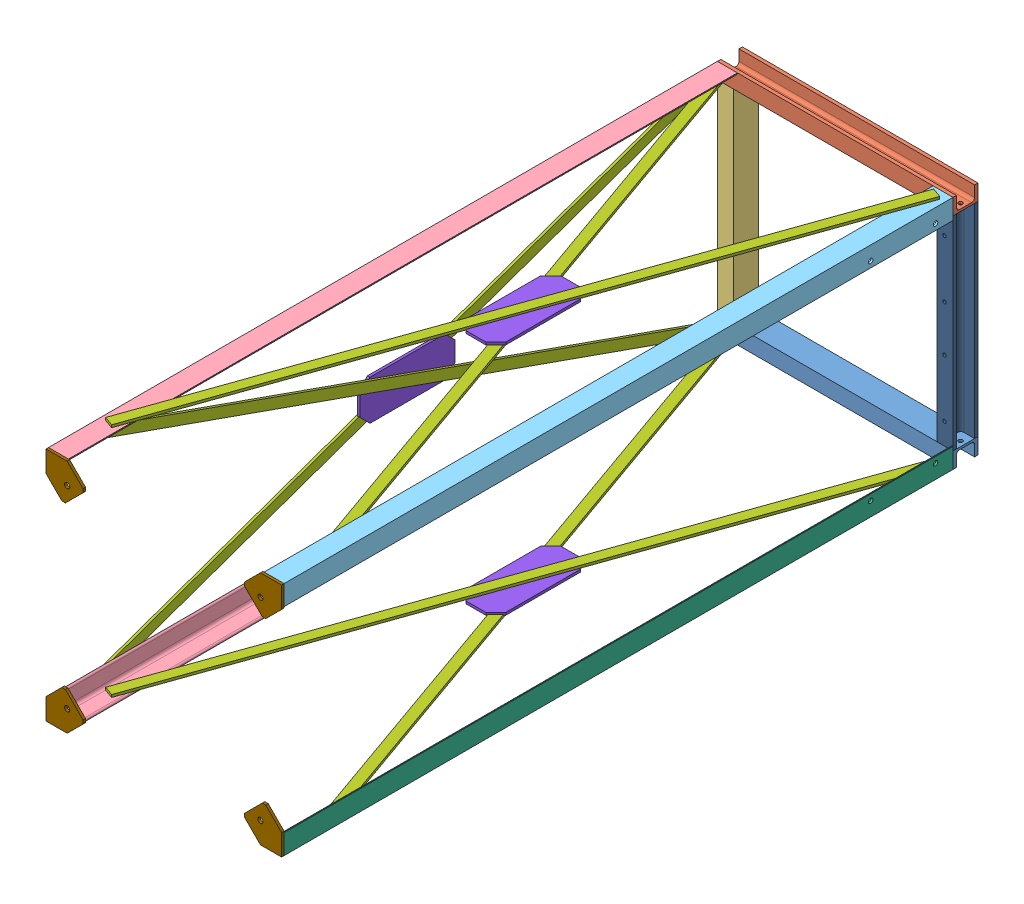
SolidWorks assembly particle separator 450.SLDASM, configuration full (file format 14000). Lengths in mm.
Overall size (514.43 514.43 2340).
30 component instances, 13 part files, 10 mates.
Components (placement in the parent):
- Bucket-1: Bucket.SLDASM [Initial] at (0 0 2400.118) x (1 0 0) z (0 0 -1) (suppressed, hidden)
- Frame-1: Frame.SLDASM [Initial] at (0 0 -1370) x (0 -1 0) z (1 0 0) size (514.43 1395 514.43)
  - Frame-basic-1: Frame-basic.SLDASM [Initial] at origin size (514.43 1395 514.43)
    - 3930-10449-4-01-1: 3930-10449-4-01.SLDPRT [Výchozí] at (220 0 0) size (32 50 472)
    - 3930-10450-4-01-1: 3930-10450-4-01.SLDPRT [Výchozí] at (-220 0 0) x (-1 0 0) z (0 0 -1) size (32 50 472)
    - 3930-10451-4-01-1: 3930-10451-4-01.SLDPRT [Výchozí] at (0 0 -220) x (0 0 -1) z (1 0 0) size (32 50 408)
    - 3930-10454-4-01-2: 3930-10454-4-01.SLDPRT [Výchozí] at (-216 -695 -216) x (1 0 0) z (0 -1 0) size (40 40 1340)
    - 3930-10454-4-01-1: 3930-10454-4-01.SLDPRT [Výchozí] at (216 -695 -216) x (0 0 1) z (0 -1 0) size (40 40 1340)
    - 3930-10455-4-01-1: 3930-10455-4-01.SLDPRT [Výchozí] at (-216 -695 216) x (1 0 0) z (0 1 0) size (40 40 1340)
    - 3930-10456-4-01-1: 3930-10456-4-01.SLDPRT [Výchozí] at (216 -695 216) x (0 0 -1) z (0 1 0) size (40 40 1340)
    - 3930-10459-4-01-4: 3930-10459-4-01.SLDPRT [Výchozí] at (-232 -651.1914 0) x (0 -0.333187 -0.942861) z (1 0 0) size (20 1300 5)
    - 3930-10459-4-01-1: 3930-10459-4-01.SLDPRT [Výchozí] at (-241 -651.1914 0) x (0 0.333187 -0.942861) z (1 0 0) size (20 1300 5)
    - Cross Gusset-1: Cross Gusset.SLDPRT [Výchozí] at (-232 -650 0) x (0 0 1) z (-1 0 0) size (80 190 5)
    - Feet-1: Feet.SLDPRT [Výchozí] at (-207.7157 -1370 207.7157) x (0.707107 0 -0.707107) z (0 1 0) size (80 60 5)
    - Feet-2: Feet.SLDPRT [Výchozí] at (207.7157 -1370 207.7157) x (-0.707107 0 -0.707107) z (0 1 0) size (80 60 5)
    - Feet-3: Feet.SLDPRT [Výchozí] at (207.7157 -1370 -207.7157) x (-0.707107 0 0.707107) z (0 1 0) size (80 60 5)
    - Feet-4: Feet.SLDPRT [Výchozí] at (-207.7157 -1370 -207.7157) x (0.707107 0 0.707107) z (0 1 0) size (80 60 5)
    - Cross Gusset-2: Cross Gusset.SLDPRT [Výchozí] at (0 -650 -232) x (-1 0 0) z (0 0 -1) size (80 190 5)
    - Cross Gusset-3: Cross Gusset.SLDPRT [Výchozí] at (232 -650 0) x (0 0 -1) z (1 0 0) size (80 190 5)
    - 3930-10459-4-01-5: 3930-10459-4-01.SLDPRT [Výchozí] at (0 -651.1914 -232) x (0.942861 -0.333187 0) z (0 0 1) size (20 1300 5)
    - 3930-10459-4-01-6: 3930-10459-4-01.SLDPRT [Výchozí] at (232 -651.1914 0) x (0 -0.333187 0.942861) z (-1 0 0) size (20 1300 5)
    - 3930-10459-4-01-2: 3930-10459-4-01.SLDPRT [Výchozí] at (0 -651.1914 -241) x (0.942861 0.333187 0) z (0 0 1) size (20 1300 5)
    - 3930-10459-4-01-3: 3930-10459-4-01.SLDPRT [Výchozí] at (241 -651.1914 0) x (0 0.333187 0.942861) z (-1 0 0) size (20 1300 5)
    - 3930-10108-4-01-1: 3930-10108-4-01.SLDPRT [Výchozí] at (-207 -25 217.5) x (0 0 1) z (0 -1 0) (suppressed, hidden)
    - 3930-10108-4-01-2: 3930-10108-4-01.SLDPRT [Výchozí] at (207 -25 217.5) x (0 0 1) z (0 -1 0) (suppressed, hidden)
  - Beam-1: Beam.SLDASM [Initial] at (0 0 220) x (0 0 1) z (-1 0 0) size (32 50 408)
    - 3930-10452-4-01-1: 3930-10452-4-01.SLDPRT [Výchozí] at origin size (32 50 408)
    - 3930-10104-4-01-1: 3930-10104-4-01.SLDPRT [Výchozí] at (2.5 0 199) (suppressed, hidden)
    - 3930-10104-4-01-2: 3930-10104-4-01.SLDPRT [Výchozí] at (2.5 0 -204) (suppressed, hidden)
- Cylcone Particle Separator-1: Cylcone Particle Separator.SLDPRT [Default<As Machined>] at (0 0 -2340) x (1 0 0) z (0 1 0) size (477.39 1845 480.7)
Mates (geometry in assembly coordinates):
- Sjednocený1: coincident: plane of Bucket-1 through (0 0 2400.118) normal (0 -1 0); plane of assembly through (0 0 0) normal (0 1 0)
- Sjednocený2: coincident: plane of Bucket-1; plane of assembly through (0 0 0) normal (1 0 0)
- Sjednocený4: coincident aligned: plane of Frame-1 through (0 0 -1370) normal (1 0 0); plane of assembly through (0 0 0) normal (1 0 0)
- Sjednocený5: coincident anti-aligned: plane of Frame-1 through (0 0 -1370) normal (0 -1 0); plane of assembly through (0 0 0) normal (0 1 0)
- Coincident9: coincident anti-aligned: plane of Frame-1/Frame-basic-1/3930-10451-4-01-1 through (-204 -204 -1395) normal (0 0 -1); plane of Cylcone Particle Separator-1 through (-238.6857 -60 -1395) normal (0 0 1)
- Parallel2: parallel aligned: plane of Frame-1/Frame-basic-1/3930-10451-4-01-1 through (-236 -204 -1395) normal (-1 0 0); plane of Cylcone Particle Separator-1 through (-238.6857 56 -1403) normal (-1 0 0)
- Parallel1: parallel aligned: plane of Frame-1/Frame-basic-1/3930-10449-4-01-1 through (236 -236 -1395) normal (0 -1 0); plane of Cylcone Particle Separator-1 through (-56 -238.6857 -1403) normal (0 -1 0)
- Coincident13: coincident aligned: plane of Frame-1/Frame-basic-1/Feet-1 through (257.2132 214.7868 0) normal (0 0 1); plane of assembly through (0 0 0) normal (0 0 1)
- Width5: width anti-aligned: plane of Frame-1/Frame-basic-1/3930-10450-4-01-1 through (236 214.4 -1382.2) normal (1 0 0); plane of Cylcone Particle Separator-1 through (-236 214.4 -1382.2) normal (-1 0 0); plane of Frame-1/Frame-basic-1/3930-10450-4-01-1 through (-60 238.6857 -1495) normal (-1 0 0); plane of Cylcone Particle Separator-1 through (60 238.6857 -1495) normal (1 0 0)
- Width6: width anti-aligned: plane of Frame-1/Frame-basic-1/3930-10450-4-01-1 through (-236 236 -1395) normal (0 1 0); plane of Cylcone Particle Separator-1 through (236 -236 -1395) normal (0 -1 0); plane of Frame-1/Frame-basic-1/3930-10449-4-01-1 through (238.6857 -60 -1495) normal (0 -1 0); plane of Cylcone Particle Separator-1 through (238.6857 60 -1495) normal (0 1 0)
